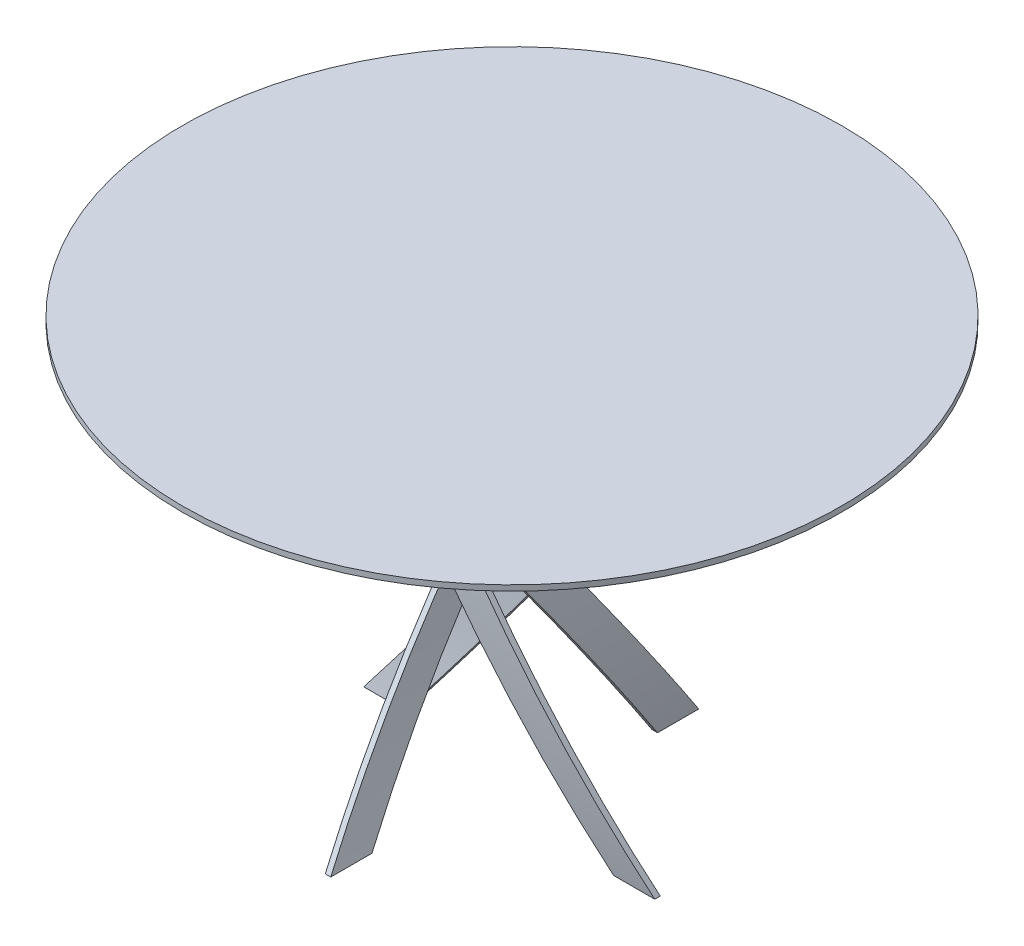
ISO-10303-21;
HEADER;
FILE_DESCRIPTION(('STEP AP214'),'2;1');
FILE_NAME('part.step','',(''),(''),'','','');
FILE_SCHEMA(('AUTOMOTIVE_DESIGN { 1 0 10303 214 1 1 1 1 }'));
ENDSEC;
DATA;
#1=APPLICATION_CONTEXT('core data for automotive mechanical design processes');
#2=APPLICATION_PROTOCOL_DEFINITION('international standard','automotive_design',2000,#1);
#3=PRODUCT_CONTEXT('',#1,'mechanical');
#4=PRODUCT('Part','Part','',(#3));
#5=PRODUCT_RELATED_PRODUCT_CATEGORY('part','',(#4));
#6=PRODUCT_DEFINITION_FORMATION('','',#4);
#7=PRODUCT_DEFINITION_CONTEXT('part definition',#1,'design');
#8=PRODUCT_DEFINITION('design','',#6,#7);
#9=PRODUCT_DEFINITION_SHAPE('','',#8);
#10=(LENGTH_UNIT() NAMED_UNIT(*) SI_UNIT(.MILLI.,.METRE.));
#11=(NAMED_UNIT(*) PLANE_ANGLE_UNIT() SI_UNIT($,.RADIAN.));
#12=(NAMED_UNIT(*) SI_UNIT($,.STERADIAN.) SOLID_ANGLE_UNIT());
#13=UNCERTAINTY_MEASURE_WITH_UNIT(LENGTH_MEASURE(1.E-05),#10,'distance_accuracy_value','');
#14=(GEOMETRIC_REPRESENTATION_CONTEXT(3) GLOBAL_UNCERTAINTY_ASSIGNED_CONTEXT((#13)) GLOBAL_UNIT_ASSIGNED_CONTEXT((#10,
#11,#12)) REPRESENTATION_CONTEXT('',''));
#15=CARTESIAN_POINT('',(0.,0.,0.));
#16=DIRECTION('',(0.,0.,1.));
#17=DIRECTION('',(1.,0.,0.));
#18=AXIS2_PLACEMENT_3D('',#15,#16,#17);
#19=CARTESIAN_POINT('',(-300.000000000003,-1.11022302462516E-13,299.999999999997));
#20=DIRECTION('',(0.,0.589469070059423,0.807790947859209));
#21=DIRECTION('',(0.,-0.807790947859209,0.589469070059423));
#22=AXIS2_PLACEMENT_3D('',#19,#20,#21);
#23=PLANE('',#22);
#24=DIRECTION('',(1.,0.,0.));
#25=VECTOR('',#24,1.);
#26=CARTESIAN_POINT('',(-299.999999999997,740.,-240.000000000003));
#27=LINE('',#26,#25);
#28=CARTESIAN_POINT('',(-39.9999999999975,740.,-240.));
#29=VERTEX_POINT('',#28);
#30=CARTESIAN_POINT('',(-29.9999999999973,740.,-240.));
#31=VERTEX_POINT('',#30);
#32=EDGE_CURVE('E109',#29,#31,#27,.T.);
#33=ORIENTED_EDGE('',*,*,#32,.F.);
#34=CARTESIAN_POINT('',(1721.56180703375,370.,30.0000000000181));
#35=DIRECTION('',(0.,0.589469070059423,0.807790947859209));
#36=DIRECTION('',(0.,0.807790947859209,-0.589469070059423));
#37=AXIS2_PLACEMENT_3D('',#34,#35,#36);
#38=ELLIPSE('',#37,2228.29929546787,1800.);
#39=CARTESIAN_POINT('',(-40.0000000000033,-1.11022302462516E-13,300.));
#40=VERTEX_POINT('',#39);
#41=EDGE_CURVE('E91',#29,#40,#38,.T.);
#42=ORIENTED_EDGE('',*,*,#41,.T.);
#43=DIRECTION('',(1.,0.,0.));
#44=VECTOR('',#43,1.);
#45=CARTESIAN_POINT('',(-300.000000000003,-1.11022302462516E-13,299.999999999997));
#46=LINE('',#45,#44);
#47=CARTESIAN_POINT('',(-30.0000000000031,-1.11022302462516E-13,300.));
#48=VERTEX_POINT('',#47);
#49=EDGE_CURVE('E111',#40,#48,#46,.T.);
#50=ORIENTED_EDGE('',*,*,#49,.T.);
#51=CARTESIAN_POINT('',(1731.56180703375,370.,30.0000000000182));
#52=DIRECTION('',(0.,0.589469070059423,0.807790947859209));
#53=DIRECTION('',(0.,0.807790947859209,-0.589469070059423));
#54=AXIS2_PLACEMENT_3D('',#51,#52,#53);
#55=ELLIPSE('',#54,2228.29929546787,1800.);
#56=EDGE_CURVE('E96',#48,#31,#55,.F.);
#57=ORIENTED_EDGE('',*,*,#56,.T.);
#58=EDGE_LOOP('',(#33,#42,#50,#57));
#59=FACE_BOUND('',#58,.T.);
#60=ADVANCED_FACE('F46',(#59),#23,.T.);
#61=CARTESIAN_POINT('',(1721.56180703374,370.,500.000000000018));
#62=DIRECTION('',(0.,0.,-1.));
#63=DIRECTION('',(-1.,0.,0.));
#64=AXIS2_PLACEMENT_3D('',#61,#62,#63);
#65=CYLINDRICAL_SURFACE('',#64,1800.);
#66=ORIENTED_EDGE('',*,*,#41,.F.);
#67=CARTESIAN_POINT('',(1721.56180703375,370.,-239.999999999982));
#68=DIRECTION('',(0.,0.,-1.));
#69=DIRECTION('',(0.,1.,0.));
#70=AXIS2_PLACEMENT_3D('',#67,#68,#69);
#71=CIRCLE('',#70,1800.);
#72=CARTESIAN_POINT('',(-58.4922044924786,637.222222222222,-240.000000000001));
#73=VERTEX_POINT('',#72);
#74=EDGE_CURVE('E87',#73,#29,#71,.T.);
#75=ORIENTED_EDGE('',*,*,#74,.F.);
#76=CARTESIAN_POINT('',(1721.56180703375,370.,-44.9999999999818));
#77=DIRECTION('',(0.,-0.589469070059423,-0.807790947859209));
#78=DIRECTION('',(0.,0.807790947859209,-0.589469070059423));
#79=AXIS2_PLACEMENT_3D('',#76,#77,#78);
#80=ELLIPSE('',#79,2228.29929546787,1800.);
#81=CARTESIAN_POINT('',(-40.0000000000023,-1.11022302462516E-13,225.));
#82=VERTEX_POINT('',#81);
#83=EDGE_CURVE('E50',#82,#73,#80,.T.);
#84=ORIENTED_EDGE('',*,*,#83,.F.);
#85=DIRECTION('',(0.,0.,-1.));
#86=VECTOR('',#85,1.);
#87=CARTESIAN_POINT('',(-40.0000000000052,0.,500.));
#88=LINE('',#87,#86);
#89=EDGE_CURVE('E70',#40,#82,#88,.T.);
#90=ORIENTED_EDGE('',*,*,#89,.F.);
#91=EDGE_LOOP('',(#66,#75,#84,#90));
#92=FACE_BOUND('',#91,.T.);
#93=ADVANCED_FACE('F89',(#92),#65,.T.);
#94=CARTESIAN_POINT('',(-299.999999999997,637.222222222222,-240.000000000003));
#95=DIRECTION('',(0.,-0.589469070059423,-0.807790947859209));
#96=DIRECTION('',(0.,0.807790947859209,-0.589469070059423));
#97=AXIS2_PLACEMENT_3D('',#94,#95,#96);
#98=PLANE('',#97);
#99=DIRECTION('',(1.,0.,0.));
#100=VECTOR('',#99,1.);
#101=CARTESIAN_POINT('',(-300.000000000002,-1.11022302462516E-13,224.999999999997));
#102=LINE('',#101,#100);
#103=CARTESIAN_POINT('',(-30.0000000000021,-1.11022302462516E-13,225.));
#104=VERTEX_POINT('',#103);
#105=EDGE_CURVE('E12',#82,#104,#102,.T.);
#106=ORIENTED_EDGE('',*,*,#105,.F.);
#107=ORIENTED_EDGE('',*,*,#83,.T.);
#108=DIRECTION('',(1.,0.,0.));
#109=VECTOR('',#108,1.);
#110=CARTESIAN_POINT('',(-299.999999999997,637.222222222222,-240.000000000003));
#111=LINE('',#110,#109);
#112=CARTESIAN_POINT('',(-48.4922044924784,637.222222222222,-240.));
#113=VERTEX_POINT('',#112);
#114=EDGE_CURVE('E55',#73,#113,#111,.T.);
#115=ORIENTED_EDGE('',*,*,#114,.T.);
#116=CARTESIAN_POINT('',(1731.56180703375,370.,-44.9999999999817));
#117=DIRECTION('',(0.,-0.589469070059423,-0.807790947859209));
#118=DIRECTION('',(0.,0.807790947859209,-0.589469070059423));
#119=AXIS2_PLACEMENT_3D('',#116,#117,#118);
#120=ELLIPSE('',#119,2228.29929546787,1800.);
#121=EDGE_CURVE('E101',#113,#104,#120,.F.);
#122=ORIENTED_EDGE('',*,*,#121,.T.);
#123=EDGE_LOOP('',(#106,#107,#115,#122));
#124=FACE_BOUND('',#123,.T.);
#125=ADVANCED_FACE('F48',(#124),#98,.T.);
#126=CARTESIAN_POINT('',(-299.999999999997,740.,-240.000000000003));
#127=DIRECTION('',(0.,0.,-1.));
#128=DIRECTION('',(0.,1.,0.));
#129=AXIS2_PLACEMENT_3D('',#126,#127,#128);
#130=PLANE('',#129);
#131=ORIENTED_EDGE('',*,*,#114,.F.);
#132=ORIENTED_EDGE('',*,*,#74,.T.);
#133=ORIENTED_EDGE('',*,*,#32,.T.);
#134=CARTESIAN_POINT('',(1731.56180703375,370.,-239.999999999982));
#135=DIRECTION('',(0.,0.,-1.));
#136=DIRECTION('',(0.,1.,0.));
#137=AXIS2_PLACEMENT_3D('',#134,#135,#136);
#138=CIRCLE('',#137,1800.);
#139=EDGE_CURVE('E97',#31,#113,#138,.F.);
#140=ORIENTED_EDGE('',*,*,#139,.T.);
#141=EDGE_LOOP('',(#131,#132,#133,#140));
#142=FACE_BOUND('',#141,.T.);
#143=ADVANCED_FACE('F102',(#142),#130,.T.);
#144=CARTESIAN_POINT('',(1731.56180703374,370.,500.000000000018));
#145=DIRECTION('',(0.,0.,-1.));
#146=DIRECTION('',(-1.,0.,0.));
#147=AXIS2_PLACEMENT_3D('',#144,#145,#146);
#148=CYLINDRICAL_SURFACE('',#147,1800.);
#149=ORIENTED_EDGE('',*,*,#56,.F.);
#150=DIRECTION('',(0.,0.,-1.));
#151=VECTOR('',#150,1.);
#152=CARTESIAN_POINT('',(-30.0000000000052,0.,500.));
#153=LINE('',#152,#151);
#154=EDGE_CURVE('E62',#48,#104,#153,.T.);
#155=ORIENTED_EDGE('',*,*,#154,.T.);
#156=ORIENTED_EDGE('',*,*,#121,.F.);
#157=ORIENTED_EDGE('',*,*,#139,.F.);
#158=EDGE_LOOP('',(#149,#155,#156,#157));
#159=FACE_BOUND('',#158,.T.);
#160=ADVANCED_FACE('F122',(#159),#148,.F.);
#161=CARTESIAN_POINT('',(-300.000000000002,-1.11022302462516E-13,224.999999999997));
#162=DIRECTION('',(0.,-1.,0.));
#163=DIRECTION('',(-1.,0.,0.));
#164=AXIS2_PLACEMENT_3D('',#161,#162,#163);
#165=PLANE('',#164);
#166=ORIENTED_EDGE('',*,*,#49,.F.);
#167=ORIENTED_EDGE('',*,*,#89,.T.);
#168=ORIENTED_EDGE('',*,*,#105,.T.);
#169=ORIENTED_EDGE('',*,*,#154,.F.);
#170=EDGE_LOOP('',(#166,#167,#168,#169));
#171=FACE_BOUND('',#170,.T.);
#172=ADVANCED_FACE('F119',(#171),#165,.T.);
#173=CLOSED_SHELL('',(#60,#93,#125,#143,#160,#172));
#174=MANIFOLD_SOLID_BREP('B2',#173);
#175=CARTESIAN_POINT('',(300.,-1.11022302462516E-13,300.));
#176=DIRECTION('',(0.807790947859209,0.589469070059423,0.));
#177=DIRECTION('',(0.589469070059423,-0.807790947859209,0.));
#178=AXIS2_PLACEMENT_3D('',#175,#176,#177);
#179=PLANE('',#178);
#180=DIRECTION('',(0.,0.,-1.));
#181=VECTOR('',#180,1.);
#182=CARTESIAN_POINT('',(-240.,740.,300.));
#183=LINE('',#182,#181);
#184=CARTESIAN_POINT('',(-240.,740.,40.));
#185=VERTEX_POINT('',#184);
#186=CARTESIAN_POINT('',(-240.,740.,29.9999999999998));
#187=VERTEX_POINT('',#186);
#188=EDGE_CURVE('E255',#185,#187,#183,.T.);
#189=ORIENTED_EDGE('',*,*,#188,.F.);
#190=CARTESIAN_POINT('',(30.,370.,-1721.56180703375));
#191=DIRECTION('',(0.807790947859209,0.589469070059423,0.));
#192=DIRECTION('',(-0.589469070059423,0.807790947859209,0.));
#193=AXIS2_PLACEMENT_3D('',#190,#191,#192);
#194=ELLIPSE('',#193,2228.29929546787,1800.);
#195=CARTESIAN_POINT('',(300.,-1.11022302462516E-13,40.0000000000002));
#196=VERTEX_POINT('',#195);
#197=EDGE_CURVE('E237',#185,#196,#194,.T.);
#198=ORIENTED_EDGE('',*,*,#197,.T.);
#199=DIRECTION('',(0.,0.,-1.));
#200=VECTOR('',#199,1.);
#201=CARTESIAN_POINT('',(300.,-1.11022302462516E-13,300.));
#202=LINE('',#201,#200);
#203=CARTESIAN_POINT('',(300.,-1.11022302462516E-13,30.));
#204=VERTEX_POINT('',#203);
#205=EDGE_CURVE('E257',#196,#204,#202,.T.);
#206=ORIENTED_EDGE('',*,*,#205,.T.);
#207=CARTESIAN_POINT('',(30.,370.,-1731.56180703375));
#208=DIRECTION('',(0.807790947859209,0.589469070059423,0.));
#209=DIRECTION('',(-0.589469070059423,0.807790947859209,0.));
#210=AXIS2_PLACEMENT_3D('',#207,#208,#209);
#211=ELLIPSE('',#210,2228.29929546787,1800.);
#212=EDGE_CURVE('E242',#204,#187,#211,.F.);
#213=ORIENTED_EDGE('',*,*,#212,.T.);
#214=EDGE_LOOP('',(#189,#198,#206,#213));
#215=FACE_BOUND('',#214,.T.);
#216=ADVANCED_FACE('F192',(#215),#179,.T.);
#217=CARTESIAN_POINT('',(500.,370.,-1721.56180703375));
#218=DIRECTION('',(-1.,0.,0.));
#219=DIRECTION('',(0.,0.,1.));
#220=AXIS2_PLACEMENT_3D('',#217,#218,#219);
#221=CYLINDRICAL_SURFACE('',#220,1800.);
#222=ORIENTED_EDGE('',*,*,#197,.F.);
#223=CARTESIAN_POINT('',(-240.,370.,-1721.56180703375));
#224=DIRECTION('',(-1.,0.,0.));
#225=DIRECTION('',(0.,1.,0.));
#226=AXIS2_PLACEMENT_3D('',#223,#224,#225);
#227=CIRCLE('',#226,1800.);
#228=CARTESIAN_POINT('',(-240.,637.222222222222,58.4922044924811));
#229=VERTEX_POINT('',#228);
#230=EDGE_CURVE('E233',#229,#185,#227,.T.);
#231=ORIENTED_EDGE('',*,*,#230,.F.);
#232=CARTESIAN_POINT('',(-44.9999999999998,370.,-1721.56180703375));
#233=DIRECTION('',(-0.807790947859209,-0.589469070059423,0.));
#234=DIRECTION('',(-0.589469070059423,0.807790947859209,0.));
#235=AXIS2_PLACEMENT_3D('',#232,#233,#234);
#236=ELLIPSE('',#235,2228.29929546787,1800.);
#237=CARTESIAN_POINT('',(225.,-1.11022302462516E-13,40.));
#238=VERTEX_POINT('',#237);
#239=EDGE_CURVE('E196',#238,#229,#236,.T.);
#240=ORIENTED_EDGE('',*,*,#239,.F.);
#241=DIRECTION('',(-1.,0.,0.));
#242=VECTOR('',#241,1.);
#243=CARTESIAN_POINT('',(500.,0.,40.));
#244=LINE('',#243,#242);
#245=EDGE_CURVE('E216',#196,#238,#244,.T.);
#246=ORIENTED_EDGE('',*,*,#245,.F.);
#247=EDGE_LOOP('',(#222,#231,#240,#246));
#248=FACE_BOUND('',#247,.T.);
#249=ADVANCED_FACE('F235',(#248),#221,.T.);
#250=CARTESIAN_POINT('',(-240.,637.222222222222,300.));
#251=DIRECTION('',(-0.807790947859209,-0.589469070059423,0.));
#252=DIRECTION('',(-0.589469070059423,0.807790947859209,0.));
#253=AXIS2_PLACEMENT_3D('',#250,#251,#252);
#254=PLANE('',#253);
#255=DIRECTION('',(0.,0.,-1.));
#256=VECTOR('',#255,1.);
#257=CARTESIAN_POINT('',(225.,-1.11022302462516E-13,300.));
#258=LINE('',#257,#256);
#259=CARTESIAN_POINT('',(225.,-1.11022302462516E-13,29.9999999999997));
#260=VERTEX_POINT('',#259);
#261=EDGE_CURVE('E44',#238,#260,#258,.T.);
#262=ORIENTED_EDGE('',*,*,#261,.F.);
#263=ORIENTED_EDGE('',*,*,#239,.T.);
#264=DIRECTION('',(0.,0.,-1.));
#265=VECTOR('',#264,1.);
#266=CARTESIAN_POINT('',(-240.,637.222222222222,300.));
#267=LINE('',#266,#265);
#268=CARTESIAN_POINT('',(-240.,637.222222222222,48.4922044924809));
#269=VERTEX_POINT('',#268);
#270=EDGE_CURVE('E201',#229,#269,#267,.T.);
#271=ORIENTED_EDGE('',*,*,#270,.T.);
#272=CARTESIAN_POINT('',(-44.9999999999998,370.,-1731.56180703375));
#273=DIRECTION('',(-0.807790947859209,-0.589469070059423,0.));
#274=DIRECTION('',(-0.589469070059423,0.807790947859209,0.));
#275=AXIS2_PLACEMENT_3D('',#272,#273,#274);
#276=ELLIPSE('',#275,2228.29929546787,1800.);
#277=EDGE_CURVE('E247',#269,#260,#276,.F.);
#278=ORIENTED_EDGE('',*,*,#277,.T.);
#279=EDGE_LOOP('',(#262,#263,#271,#278));
#280=FACE_BOUND('',#279,.T.);
#281=ADVANCED_FACE('F194',(#280),#254,.T.);
#282=CARTESIAN_POINT('',(-240.,740.,300.));
#283=DIRECTION('',(-1.,0.,0.));
#284=DIRECTION('',(0.,1.,0.));
#285=AXIS2_PLACEMENT_3D('',#282,#283,#284);
#286=PLANE('',#285);
#287=ORIENTED_EDGE('',*,*,#270,.F.);
#288=ORIENTED_EDGE('',*,*,#230,.T.);
#289=ORIENTED_EDGE('',*,*,#188,.T.);
#290=CARTESIAN_POINT('',(-240.,370.,-1731.56180703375));
#291=DIRECTION('',(-1.,0.,0.));
#292=DIRECTION('',(0.,1.,0.));
#293=AXIS2_PLACEMENT_3D('',#290,#291,#292);
#294=CIRCLE('',#293,1800.);
#295=EDGE_CURVE('E243',#187,#269,#294,.F.);
#296=ORIENTED_EDGE('',*,*,#295,.T.);
#297=EDGE_LOOP('',(#287,#288,#289,#296));
#298=FACE_BOUND('',#297,.T.);
#299=ADVANCED_FACE('F248',(#298),#286,.T.);
#300=CARTESIAN_POINT('',(500.,370.,-1731.56180703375));
#301=DIRECTION('',(-1.,0.,0.));
#302=DIRECTION('',(0.,0.,1.));
#303=AXIS2_PLACEMENT_3D('',#300,#301,#302);
#304=CYLINDRICAL_SURFACE('',#303,1800.);
#305=ORIENTED_EDGE('',*,*,#212,.F.);
#306=DIRECTION('',(-1.,0.,0.));
#307=VECTOR('',#306,1.);
#308=CARTESIAN_POINT('',(500.,0.,30.));
#309=LINE('',#308,#307);
#310=EDGE_CURVE('E208',#204,#260,#309,.T.);
#311=ORIENTED_EDGE('',*,*,#310,.T.);
#312=ORIENTED_EDGE('',*,*,#277,.F.);
#313=ORIENTED_EDGE('',*,*,#295,.F.);
#314=EDGE_LOOP('',(#305,#311,#312,#313));
#315=FACE_BOUND('',#314,.T.);
#316=ADVANCED_FACE('F268',(#315),#304,.F.);
#317=CARTESIAN_POINT('',(225.,-1.11022302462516E-13,300.));
#318=DIRECTION('',(0.,-1.,0.));
#319=DIRECTION('',(0.,0.,1.));
#320=AXIS2_PLACEMENT_3D('',#317,#318,#319);
#321=PLANE('',#320);
#322=ORIENTED_EDGE('',*,*,#205,.F.);
#323=ORIENTED_EDGE('',*,*,#245,.T.);
#324=ORIENTED_EDGE('',*,*,#261,.T.);
#325=ORIENTED_EDGE('',*,*,#310,.F.);
#326=EDGE_LOOP('',(#322,#323,#324,#325));
#327=FACE_BOUND('',#326,.T.);
#328=ADVANCED_FACE('F265',(#327),#321,.T.);
#329=CLOSED_SHELL('',(#216,#249,#281,#299,#316,#328));
#330=MANIFOLD_SOLID_BREP('B6',#329);
#331=CARTESIAN_POINT('',(300.000000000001,-1.11022302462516E-13,-299.999999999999));
#332=DIRECTION('',(0.,0.589469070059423,-0.807790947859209));
#333=DIRECTION('',(0.,-0.807790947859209,-0.589469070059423));
#334=AXIS2_PLACEMENT_3D('',#331,#332,#333);
#335=PLANE('',#334);
#336=DIRECTION('',(-1.,0.,0.));
#337=VECTOR('',#336,1.);
#338=CARTESIAN_POINT('',(299.999999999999,740.,240.000000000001));
#339=LINE('',#338,#337);
#340=CARTESIAN_POINT('',(39.9999999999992,740.,240.));
#341=VERTEX_POINT('',#340);
#342=CARTESIAN_POINT('',(29.999999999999,740.,240.));
#343=VERTEX_POINT('',#342);
#344=EDGE_CURVE('E401',#341,#343,#339,.T.);
#345=ORIENTED_EDGE('',*,*,#344,.F.);
#346=CARTESIAN_POINT('',(-1721.56180703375,370.,-30.000000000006));
#347=DIRECTION('',(0.,0.589469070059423,-0.807790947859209));
#348=DIRECTION('',(0.,0.807790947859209,0.589469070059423));
#349=AXIS2_PLACEMENT_3D('',#346,#347,#348);
#350=ELLIPSE('',#349,2228.29929546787,1800.);
#351=CARTESIAN_POINT('',(40.0000000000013,-1.11022302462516E-13,-300.));
#352=VERTEX_POINT('',#351);
#353=EDGE_CURVE('E383',#341,#352,#350,.T.);
#354=ORIENTED_EDGE('',*,*,#353,.T.);
#355=DIRECTION('',(-1.,0.,0.));
#356=VECTOR('',#355,1.);
#357=CARTESIAN_POINT('',(300.000000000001,-1.11022302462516E-13,-299.999999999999));
#358=LINE('',#357,#356);
#359=CARTESIAN_POINT('',(30.000000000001,-1.11022302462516E-13,-300.));
#360=VERTEX_POINT('',#359);
#361=EDGE_CURVE('E403',#352,#360,#358,.T.);
#362=ORIENTED_EDGE('',*,*,#361,.T.);
#363=CARTESIAN_POINT('',(-1731.56180703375,370.,-30.0000000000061));
#364=DIRECTION('',(0.,0.589469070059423,-0.807790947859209));
#365=DIRECTION('',(0.,0.807790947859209,0.589469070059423));
#366=AXIS2_PLACEMENT_3D('',#363,#364,#365);
#367=ELLIPSE('',#366,2228.29929546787,1800.);
#368=EDGE_CURVE('E388',#360,#343,#367,.F.);
#369=ORIENTED_EDGE('',*,*,#368,.T.);
#370=EDGE_LOOP('',(#345,#354,#362,#369));
#371=FACE_BOUND('',#370,.T.);
#372=ADVANCED_FACE('F338',(#371),#335,.T.);
#373=CARTESIAN_POINT('',(-1721.56180703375,370.,-500.000000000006));
#374=DIRECTION('',(0.,0.,1.));
#375=DIRECTION('',(1.,0.,0.));
#376=AXIS2_PLACEMENT_3D('',#373,#374,#375);
#377=CYLINDRICAL_SURFACE('',#376,1800.);
#378=ORIENTED_EDGE('',*,*,#353,.F.);
#379=CARTESIAN_POINT('',(-1721.56180703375,370.,239.999999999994));
#380=DIRECTION('',(0.,0.,1.));
#381=DIRECTION('',(0.,1.,0.));
#382=AXIS2_PLACEMENT_3D('',#379,#380,#381);
#383=CIRCLE('',#382,1800.);
#384=CARTESIAN_POINT('',(58.4922044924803,637.222222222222,240.));
#385=VERTEX_POINT('',#384);
#386=EDGE_CURVE('E379',#385,#341,#383,.T.);
#387=ORIENTED_EDGE('',*,*,#386,.F.);
#388=CARTESIAN_POINT('',(-1721.56180703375,370.,44.9999999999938));
#389=DIRECTION('',(0.,-0.589469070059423,0.807790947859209));
#390=DIRECTION('',(0.,0.807790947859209,0.589469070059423));
#391=AXIS2_PLACEMENT_3D('',#388,#389,#390);
#392=ELLIPSE('',#391,2228.29929546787,1800.);
#393=CARTESIAN_POINT('',(40.0000000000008,-1.11022302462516E-13,-225.));
#394=VERTEX_POINT('',#393);
#395=EDGE_CURVE('E342',#394,#385,#392,.T.);
#396=ORIENTED_EDGE('',*,*,#395,.F.);
#397=DIRECTION('',(0.,0.,1.));
#398=VECTOR('',#397,1.);
#399=CARTESIAN_POINT('',(40.0000000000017,0.,-500.));
#400=LINE('',#399,#398);
#401=EDGE_CURVE('E362',#352,#394,#400,.T.);
#402=ORIENTED_EDGE('',*,*,#401,.F.);
#403=EDGE_LOOP('',(#378,#387,#396,#402));
#404=FACE_BOUND('',#403,.T.);
#405=ADVANCED_FACE('F381',(#404),#377,.T.);
#406=CARTESIAN_POINT('',(299.999999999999,637.222222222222,240.000000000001));
#407=DIRECTION('',(0.,-0.589469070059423,0.807790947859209));
#408=DIRECTION('',(0.,0.807790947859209,0.589469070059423));
#409=AXIS2_PLACEMENT_3D('',#406,#407,#408);
#410=PLANE('',#409);
#411=DIRECTION('',(-1.,0.,0.));
#412=VECTOR('',#411,1.);
#413=CARTESIAN_POINT('',(300.000000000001,-1.11022302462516E-13,-224.999999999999));
#414=LINE('',#413,#412);
#415=CARTESIAN_POINT('',(30.0000000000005,-1.11022302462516E-13,-225.));
#416=VERTEX_POINT('',#415);
#417=EDGE_CURVE('E190',#394,#416,#414,.T.);
#418=ORIENTED_EDGE('',*,*,#417,.F.);
#419=ORIENTED_EDGE('',*,*,#395,.T.);
#420=DIRECTION('',(-1.,0.,0.));
#421=VECTOR('',#420,1.);
#422=CARTESIAN_POINT('',(299.999999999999,637.222222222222,240.000000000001));
#423=LINE('',#422,#421);
#424=CARTESIAN_POINT('',(48.49220449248,637.222222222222,240.));
#425=VERTEX_POINT('',#424);
#426=EDGE_CURVE('E347',#385,#425,#423,.T.);
#427=ORIENTED_EDGE('',*,*,#426,.T.);
#428=CARTESIAN_POINT('',(-1731.56180703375,370.,44.9999999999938));
#429=DIRECTION('',(0.,-0.589469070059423,0.807790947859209));
#430=DIRECTION('',(0.,0.807790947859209,0.589469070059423));
#431=AXIS2_PLACEMENT_3D('',#428,#429,#430);
#432=ELLIPSE('',#431,2228.29929546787,1800.);
#433=EDGE_CURVE('E393',#425,#416,#432,.F.);
#434=ORIENTED_EDGE('',*,*,#433,.T.);
#435=EDGE_LOOP('',(#418,#419,#427,#434));
#436=FACE_BOUND('',#435,.T.);
#437=ADVANCED_FACE('F340',(#436),#410,.T.);
#438=CARTESIAN_POINT('',(299.999999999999,740.,240.000000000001));
#439=DIRECTION('',(0.,0.,1.));
#440=DIRECTION('',(0.,1.,0.));
#441=AXIS2_PLACEMENT_3D('',#438,#439,#440);
#442=PLANE('',#441);
#443=ORIENTED_EDGE('',*,*,#426,.F.);
#444=ORIENTED_EDGE('',*,*,#386,.T.);
#445=ORIENTED_EDGE('',*,*,#344,.T.);
#446=CARTESIAN_POINT('',(-1731.56180703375,370.,239.999999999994));
#447=DIRECTION('',(0.,0.,1.));
#448=DIRECTION('',(0.,1.,0.));
#449=AXIS2_PLACEMENT_3D('',#446,#447,#448);
#450=CIRCLE('',#449,1800.);
#451=EDGE_CURVE('E389',#343,#425,#450,.F.);
#452=ORIENTED_EDGE('',*,*,#451,.T.);
#453=EDGE_LOOP('',(#443,#444,#445,#452));
#454=FACE_BOUND('',#453,.T.);
#455=ADVANCED_FACE('F394',(#454),#442,.T.);
#456=CARTESIAN_POINT('',(-1731.56180703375,370.,-500.000000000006));
#457=DIRECTION('',(0.,0.,1.));
#458=DIRECTION('',(1.,0.,0.));
#459=AXIS2_PLACEMENT_3D('',#456,#457,#458);
#460=CYLINDRICAL_SURFACE('',#459,1800.);
#461=ORIENTED_EDGE('',*,*,#368,.F.);
#462=DIRECTION('',(0.,0.,1.));
#463=VECTOR('',#462,1.);
#464=CARTESIAN_POINT('',(30.0000000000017,0.,-500.));
#465=LINE('',#464,#463);
#466=EDGE_CURVE('E354',#360,#416,#465,.T.);
#467=ORIENTED_EDGE('',*,*,#466,.T.);
#468=ORIENTED_EDGE('',*,*,#433,.F.);
#469=ORIENTED_EDGE('',*,*,#451,.F.);
#470=EDGE_LOOP('',(#461,#467,#468,#469));
#471=FACE_BOUND('',#470,.T.);
#472=ADVANCED_FACE('F414',(#471),#460,.F.);
#473=CARTESIAN_POINT('',(300.000000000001,-1.11022302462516E-13,-224.999999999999));
#474=DIRECTION('',(0.,-1.,0.));
#475=DIRECTION('',(1.,0.,0.));
#476=AXIS2_PLACEMENT_3D('',#473,#474,#475);
#477=PLANE('',#476);
#478=ORIENTED_EDGE('',*,*,#361,.F.);
#479=ORIENTED_EDGE('',*,*,#401,.T.);
#480=ORIENTED_EDGE('',*,*,#417,.T.);
#481=ORIENTED_EDGE('',*,*,#466,.F.);
#482=EDGE_LOOP('',(#478,#479,#480,#481));
#483=FACE_BOUND('',#482,.T.);
#484=ADVANCED_FACE('F411',(#483),#477,.T.);
#485=CLOSED_SHELL('',(#372,#405,#437,#455,#472,#484));
#486=MANIFOLD_SOLID_BREP('B38',#485);
#487=CARTESIAN_POINT('',(-300.,-1.11022302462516E-13,-300.));
#488=DIRECTION('',(-0.807790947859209,0.589469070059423,0.));
#489=DIRECTION('',(-0.589469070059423,-0.807790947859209,0.));
#490=AXIS2_PLACEMENT_3D('',#487,#488,#489);
#491=PLANE('',#490);
#492=DIRECTION('',(0.,0.,1.));
#493=VECTOR('',#492,1.);
#494=CARTESIAN_POINT('',(240.,740.,-300.));
#495=LINE('',#494,#493);
#496=CARTESIAN_POINT('',(240.,740.,-40.));
#497=VERTEX_POINT('',#496);
#498=CARTESIAN_POINT('',(240.,740.,-29.9999999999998));
#499=VERTEX_POINT('',#498);
#500=EDGE_CURVE('E544',#497,#499,#495,.T.);
#501=ORIENTED_EDGE('',*,*,#500,.F.);
#502=CARTESIAN_POINT('',(-30.,370.,1721.56180703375));
#503=DIRECTION('',(-0.807790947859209,0.589469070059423,0.));
#504=DIRECTION('',(0.589469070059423,0.807790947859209,0.));
#505=AXIS2_PLACEMENT_3D('',#502,#503,#504);
#506=ELLIPSE('',#505,2228.29929546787,1800.);
#507=CARTESIAN_POINT('',(-300.,-1.11022302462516E-13,-40.0000000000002));
#508=VERTEX_POINT('',#507);
#509=EDGE_CURVE('E526',#497,#508,#506,.T.);
#510=ORIENTED_EDGE('',*,*,#509,.T.);
#511=DIRECTION('',(0.,0.,1.));
#512=VECTOR('',#511,1.);
#513=CARTESIAN_POINT('',(-300.,-1.11022302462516E-13,-300.));
#514=LINE('',#513,#512);
#515=CARTESIAN_POINT('',(-300.,-1.11022302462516E-13,-30.));
#516=VERTEX_POINT('',#515);
#517=EDGE_CURVE('E546',#508,#516,#514,.T.);
#518=ORIENTED_EDGE('',*,*,#517,.T.);
#519=CARTESIAN_POINT('',(-30.,370.,1731.56180703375));
#520=DIRECTION('',(-0.807790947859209,0.589469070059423,0.));
#521=DIRECTION('',(0.589469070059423,0.807790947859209,0.));
#522=AXIS2_PLACEMENT_3D('',#519,#520,#521);
#523=ELLIPSE('',#522,2228.29929546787,1800.);
#524=EDGE_CURVE('E531',#516,#499,#523,.F.);
#525=ORIENTED_EDGE('',*,*,#524,.T.);
#526=EDGE_LOOP('',(#501,#510,#518,#525));
#527=FACE_BOUND('',#526,.T.);
#528=ADVANCED_FACE('F481',(#527),#491,.T.);
#529=CARTESIAN_POINT('',(-500.,370.,1721.56180703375));
#530=DIRECTION('',(1.,0.,0.));
#531=DIRECTION('',(0.,0.,-1.));
#532=AXIS2_PLACEMENT_3D('',#529,#530,#531);
#533=CYLINDRICAL_SURFACE('',#532,1800.);
#534=ORIENTED_EDGE('',*,*,#509,.F.);
#535=CARTESIAN_POINT('',(240.,370.,1721.56180703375));
#536=DIRECTION('',(1.,0.,0.));
#537=DIRECTION('',(0.,1.,0.));
#538=AXIS2_PLACEMENT_3D('',#535,#536,#537);
#539=CIRCLE('',#538,1800.);
#540=CARTESIAN_POINT('',(240.,637.222222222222,-58.4922044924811));
#541=VERTEX_POINT('',#540);
#542=EDGE_CURVE('E522',#541,#497,#539,.T.);
#543=ORIENTED_EDGE('',*,*,#542,.F.);
#544=CARTESIAN_POINT('',(44.9999999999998,370.,1721.56180703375));
#545=DIRECTION('',(0.807790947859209,-0.589469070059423,0.));
#546=DIRECTION('',(0.589469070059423,0.807790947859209,0.));
#547=AXIS2_PLACEMENT_3D('',#544,#545,#546);
#548=ELLIPSE('',#547,2228.29929546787,1800.);
#549=CARTESIAN_POINT('',(-225.,-1.11022302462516E-13,-40.));
#550=VERTEX_POINT('',#549);
#551=EDGE_CURVE('E485',#550,#541,#548,.T.);
#552=ORIENTED_EDGE('',*,*,#551,.F.);
#553=DIRECTION('',(1.,0.,0.));
#554=VECTOR('',#553,1.);
#555=CARTESIAN_POINT('',(-500.,0.,-40.));
#556=LINE('',#555,#554);
#557=EDGE_CURVE('E505',#508,#550,#556,.T.);
#558=ORIENTED_EDGE('',*,*,#557,.F.);
#559=EDGE_LOOP('',(#534,#543,#552,#558));
#560=FACE_BOUND('',#559,.T.);
#561=ADVANCED_FACE('F524',(#560),#533,.T.);
#562=CARTESIAN_POINT('',(240.,637.222222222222,-300.));
#563=DIRECTION('',(0.807790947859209,-0.589469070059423,0.));
#564=DIRECTION('',(0.589469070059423,0.807790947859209,0.));
#565=AXIS2_PLACEMENT_3D('',#562,#563,#564);
#566=PLANE('',#565);
#567=DIRECTION('',(0.,0.,1.));
#568=VECTOR('',#567,1.);
#569=CARTESIAN_POINT('',(-225.,-1.11022302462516E-13,-300.));
#570=LINE('',#569,#568);
#571=CARTESIAN_POINT('',(-225.,-1.11022302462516E-13,-29.9999999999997));
#572=VERTEX_POINT('',#571);
#573=EDGE_CURVE('E336',#550,#572,#570,.T.);
#574=ORIENTED_EDGE('',*,*,#573,.F.);
#575=ORIENTED_EDGE('',*,*,#551,.T.);
#576=DIRECTION('',(0.,0.,1.));
#577=VECTOR('',#576,1.);
#578=CARTESIAN_POINT('',(240.,637.222222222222,-300.));
#579=LINE('',#578,#577);
#580=CARTESIAN_POINT('',(240.,637.222222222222,-48.4922044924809));
#581=VERTEX_POINT('',#580);
#582=EDGE_CURVE('E490',#541,#581,#579,.T.);
#583=ORIENTED_EDGE('',*,*,#582,.T.);
#584=CARTESIAN_POINT('',(44.9999999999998,370.,1731.56180703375));
#585=DIRECTION('',(0.807790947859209,-0.589469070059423,0.));
#586=DIRECTION('',(0.589469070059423,0.807790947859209,0.));
#587=AXIS2_PLACEMENT_3D('',#584,#585,#586);
#588=ELLIPSE('',#587,2228.29929546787,1800.);
#589=EDGE_CURVE('E536',#581,#572,#588,.F.);
#590=ORIENTED_EDGE('',*,*,#589,.T.);
#591=EDGE_LOOP('',(#574,#575,#583,#590));
#592=FACE_BOUND('',#591,.T.);
#593=ADVANCED_FACE('F483',(#592),#566,.T.);
#594=CARTESIAN_POINT('',(240.,740.,-300.));
#595=DIRECTION('',(1.,0.,0.));
#596=DIRECTION('',(0.,1.,0.));
#597=AXIS2_PLACEMENT_3D('',#594,#595,#596);
#598=PLANE('',#597);
#599=ORIENTED_EDGE('',*,*,#582,.F.);
#600=ORIENTED_EDGE('',*,*,#542,.T.);
#601=ORIENTED_EDGE('',*,*,#500,.T.);
#602=CARTESIAN_POINT('',(240.,370.,1731.56180703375));
#603=DIRECTION('',(1.,0.,0.));
#604=DIRECTION('',(0.,1.,0.));
#605=AXIS2_PLACEMENT_3D('',#602,#603,#604);
#606=CIRCLE('',#605,1800.);
#607=EDGE_CURVE('E532',#499,#581,#606,.F.);
#608=ORIENTED_EDGE('',*,*,#607,.T.);
#609=EDGE_LOOP('',(#599,#600,#601,#608));
#610=FACE_BOUND('',#609,.T.);
#611=ADVANCED_FACE('F537',(#610),#598,.T.);
#612=CARTESIAN_POINT('',(-500.,370.,1731.56180703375));
#613=DIRECTION('',(1.,0.,0.));
#614=DIRECTION('',(0.,0.,-1.));
#615=AXIS2_PLACEMENT_3D('',#612,#613,#614);
#616=CYLINDRICAL_SURFACE('',#615,1800.);
#617=ORIENTED_EDGE('',*,*,#524,.F.);
#618=DIRECTION('',(1.,0.,0.));
#619=VECTOR('',#618,1.);
#620=CARTESIAN_POINT('',(-500.,0.,-30.));
#621=LINE('',#620,#619);
#622=EDGE_CURVE('E497',#516,#572,#621,.T.);
#623=ORIENTED_EDGE('',*,*,#622,.T.);
#624=ORIENTED_EDGE('',*,*,#589,.F.);
#625=ORIENTED_EDGE('',*,*,#607,.F.);
#626=EDGE_LOOP('',(#617,#623,#624,#625));
#627=FACE_BOUND('',#626,.T.);
#628=ADVANCED_FACE('F557',(#627),#616,.F.);
#629=CARTESIAN_POINT('',(-225.,-1.11022302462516E-13,-300.));
#630=DIRECTION('',(0.,-1.,0.));
#631=DIRECTION('',(0.,0.,-1.));
#632=AXIS2_PLACEMENT_3D('',#629,#630,#631);
#633=PLANE('',#632);
#634=ORIENTED_EDGE('',*,*,#517,.F.);
#635=ORIENTED_EDGE('',*,*,#557,.T.);
#636=ORIENTED_EDGE('',*,*,#573,.T.);
#637=ORIENTED_EDGE('',*,*,#622,.F.);
#638=EDGE_LOOP('',(#634,#635,#636,#637));
#639=FACE_BOUND('',#638,.T.);
#640=ADVANCED_FACE('F554',(#639),#633,.T.);
#641=CLOSED_SHELL('',(#528,#561,#593,#611,#628,#640));
#642=MANIFOLD_SOLID_BREP('B184',#641);
#643=CARTESIAN_POINT('',(0.,750.,0.));
#644=DIRECTION('',(0.,-1.,0.));
#645=DIRECTION('',(0.,0.,-1.));
#646=AXIS2_PLACEMENT_3D('',#643,#644,#645);
#647=CYLINDRICAL_SURFACE('',#646,600.);
#648=CARTESIAN_POINT('',(0.,750.,0.));
#649=DIRECTION('',(0.,1.,0.));
#650=DIRECTION('',(0.,0.,1.));
#651=AXIS2_PLACEMENT_3D('',#648,#649,#650);
#652=CIRCLE('',#651,600.);
#653=CARTESIAN_POINT('',(0.,750.,600.));
#654=VERTEX_POINT('',#653);
#655=EDGE_CURVE('E480',#654,#654,#652,.T.);
#656=ORIENTED_EDGE('',*,*,#655,.F.);
#657=EDGE_LOOP('',(#656));
#658=FACE_BOUND('',#657,.T.);
#659=CARTESIAN_POINT('',(0.,740.,0.));
#660=DIRECTION('',(0.,1.,0.));
#661=DIRECTION('',(0.,0.,1.));
#662=AXIS2_PLACEMENT_3D('',#659,#660,#661);
#663=CIRCLE('',#662,600.);
#664=CARTESIAN_POINT('',(0.,740.,600.));
#665=VERTEX_POINT('',#664);
#666=EDGE_CURVE('E608',#665,#665,#663,.T.);
#667=ORIENTED_EDGE('',*,*,#666,.T.);
#668=EDGE_LOOP('',(#667));
#669=FACE_BOUND('',#668,.T.);
#670=ADVANCED_FACE('F605',(#658,#669),#647,.T.);
#671=CARTESIAN_POINT('',(0.,750.,0.));
#672=DIRECTION('',(0.,1.,0.));
#673=DIRECTION('',(0.,0.,1.));
#674=AXIS2_PLACEMENT_3D('',#671,#672,#673);
#675=PLANE('',#674);
#676=ORIENTED_EDGE('',*,*,#655,.T.);
#677=EDGE_LOOP('',(#676));
#678=FACE_BOUND('',#677,.T.);
#679=ADVANCED_FACE('F620',(#678),#675,.T.);
#680=CARTESIAN_POINT('',(0.,740.,0.));
#681=DIRECTION('',(0.,1.,0.));
#682=DIRECTION('',(0.,0.,1.));
#683=AXIS2_PLACEMENT_3D('',#680,#681,#682);
#684=PLANE('',#683);
#685=ORIENTED_EDGE('',*,*,#666,.F.);
#686=EDGE_LOOP('',(#685));
#687=FACE_BOUND('',#686,.T.);
#688=ADVANCED_FACE('F618',(#687),#684,.F.);
#689=CLOSED_SHELL('',(#670,#679,#688));
#690=MANIFOLD_SOLID_BREP('B330',#689);
#691=ADVANCED_BREP_SHAPE_REPRESENTATION('',(#18,#174,#330,#486,#642,#690),#14);
#692=SHAPE_DEFINITION_REPRESENTATION(#9,#691);
ENDSEC;
END-ISO-10303-21;
